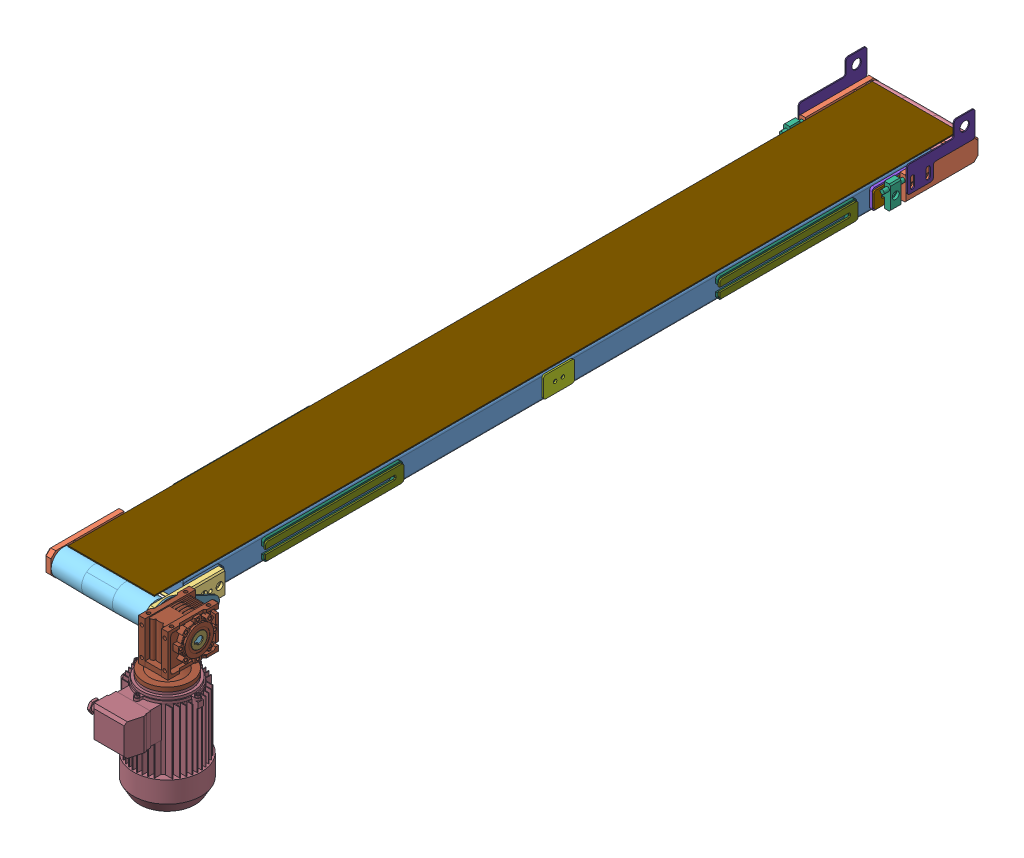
SolidWorks assembly 14k040 convoyeur inox 1518.SLDASM, configuration Défaut (file format 10000). Lengths in mm.
Overall size (315.5 318 1712.65).
39 component instances, 18 part files, 65 mates.
Components (placement in the parent):
- 14k277 bati inox conv 700-1: 14k277 bati inox conv 700.SLDPRT [Défaut<Brut d'usinage>] at (-62.6526 12.5437 350) size (165 45 1435)
- 14K268V6411 support rouleau2-1: 14K268V6411 support rouleau2.SLDPRT [Défaut] at (87.8474 12.5437 -1080) x (0 1 0) z (1 0 0) size (45 140 28.5)
- 14K268V6411 support rouleau2-2: 14K268V6411 support rouleau2.SLDPRT [Défaut] at (-93.1526 12.5437 -1080) x (0 -1 0) z (-1 0 0) size (45 140 28.5)
- 14K268V6411 support rouleau2-3: 14K268V6411 support rouleau2.SLDPRT [Défaut] at (-93.1526 12.0052 399.9955) x (0 1 0) z (-1 0 0) size (45 140 28.5)
- 14k275 V6413  support rouleau arbre-1: 14k275 V6413  support rouleau arbre.SLDPRT [Défaut] at (87.8474 12.0052 399.9955) x (0 -1 0) z (1 0 0) size (45 140 28.5)
- 14k269 V1413 rouleau.Stp-1: 14k269 V1413 rouleau.Stp.SLDPRT [Défaut] at (-91.1526 12.4763 -1111.0098) x (0 -0.225951 -0.974139) z (0 -0.974139 0.225951) size (50 199 50)
- 14k276 V1563 rouleau arbre long-1: 14k276 V1563 rouleau arbre long.SLDPRT [Défaut] at (89.8474 12.371 431.4073) x (0 0.521759 0.853093) z (0 -0.853093 0.521759) size (50.22 309.04 50.51)
- 14K268 V6445 bloqueur bande-3: 14K268 V6445 bloqueur bande.SLDPRT [Défaut] at (87.8474 12.5437 -865) x (0 -1 0) z (1 0 0) size (45 40 15)
- 14K268 V6445 bloqueur bande-4: 14K268 V6445 bloqueur bande.SLDPRT [Défaut] at (-93.1526 12.5437 -1080) x (0 -1 0) z (-1 0 0) size (45 40 15)
- 14k401-1: 14k401.SLDPRT [Défaut] at (-88.1526 -6.9563 -314.5) x (0 0 -1) z (1 0 0) size (60 40 3)
- 14k401-2: 14k401.SLDPRT [Défaut] at (82.8474 -6.9563 -374.5) x (0 0 1) z (-1 0 0) size (60 40 3)
- 14k402 rainure-1: 14k402 rainure.SLDASM [Défaut] at (-85.1526 -6.9563 -1062.5) x (0 0 1) z (-1 0 0) size (120 38 8)
  - 14k402 piece rainure 1-1: 14k402 piece rainure 1.SLDPRT [Défaut] at origin size (120 38 5)
  - 14k402 piece rainure 2-1: 14k402 piece rainure 2.SLDPRT [Défaut] at (0 3 5) size (120 32 3)
- 14k402 rainure-2: 14k402 rainure.SLDASM [Défaut] at (79.8474 31.0437 -1062.5) x (0 0 1) z (1 0 0) size (120 38 8)
  - 14k402 piece rainure 1-1: 14k402 piece rainure 1.SLDPRT [Défaut] at origin size (120 38 5)
  - 14k402 piece rainure 2-1: 14k402 piece rainure 2.SLDPRT [Défaut] at (0 3 5) size (120 32 3)
- 14K403 piece fixation ep9-1: 14K403 piece fixation ep9.SLDPRT [Défaut] at (-85.1526 -6.9563 302.5) x (0 0 1) z (-1 0 0) size (70 38 8)
- 14K403 piece fixation ep9-2: 14K403 piece fixation ep9.SLDPRT [Défaut] at (79.8474 -6.9563 372.5) x (0 0 -1) z (1 0 0) size (70 38 8)
- CHM30-20-63C4-1: CHM30-20-63C4.SLDASM [Défaut] at (138.8474 12.0405 431.641) x (0 -1 0) z (-1 0 0) size (287 180 130)
  - HI_hpc_CHM30-20-63C4_1-1: HI_hpc_CHM30-20-63C4_1.sldprt [Défaut] x (0 0 -1) z (1 0 0) size (90 115 95)
  - HI_hpc_CHM30-MOT_3-1: HI_hpc_CHM30-MOT_3.sldprt [Défaut] at origin size (30 30 63)
  - HI_hpc_CHM30-20-63C4_2-1: HI_hpc_CHM30-20-63C4_2.sldprt [Défaut] at (52.5 30 0) size (194.5 175 130)
- HPC_-_CHM30-BR-1: HPC_-_CHM30-BR.SLDPRT [Défaut] at (108.0974 12.0405 431.641) x (1 0 0) z (0 -0.986223 0.165424) size (14 138 76)
- 14L402 Rainure 250mm-3: 14L402 Rainure 250mm.SLDASM [Défaut] at (-88.1526 114.338 -807.3486) x (0 0 -1) z (-1 0 0) size (265 38 8)
  - 14L402 piece rainure 1-1: 14L402 piece rainure 1.SLDPRT [Défaut] at (-159.8486 83.2943 -3) size (265 38 5)
  - 14L402 piece rainure 2-1: 14L402 piece rainure 2.SLDPRT [Défaut] at (-159.8486 86.2943 2) size (265 32 3)
- 14L402 Rainure 250mm-4: 14L402 Rainure 250mm.SLDASM [Défaut] at (82.8474 -90.2507 -807.3486) x (0 0 -1) z (1 0 0) size (265 38 8)
  - 14L402 piece rainure 1-1: 14L402 piece rainure 1.SLDPRT [Défaut] at (-159.8486 83.2943 -3) size (265 38 5)
  - 14L402 piece rainure 2-1: 14L402 piece rainure 2.SLDPRT [Défaut] at (-159.8486 86.2943 2) size (265 32 3)
- 14L402 Rainure 250mm-5: 14L402 Rainure 250mm.SLDASM [Défaut] at (82.8474 -90.2507 62.6514) x (0 0 -1) z (1 0 0) size (265 38 8)
  - 14L402 piece rainure 1-1: 14L402 piece rainure 1.SLDPRT [Défaut] at (-159.8486 83.2943 -3) size (265 38 5)
  - 14L402 piece rainure 2-1: 14L402 piece rainure 2.SLDPRT [Défaut] at (-159.8486 86.2943 2) size (265 32 3)
- 14L402 Rainure 250mm-6: 14L402 Rainure 250mm.SLDASM [Défaut] at (-88.1526 118.338 62.6514) x (0 0 -1) z (-1 0 0) size (265 38 8)
  - 14L402 piece rainure 1-1: 14L402 piece rainure 1.SLDPRT [Défaut] at (-159.8486 83.2943 -3) size (265 38 5)
  - 14L402 piece rainure 2-1: 14L402 piece rainure 2.SLDPRT [Défaut] at (-159.8486 86.2943 2) size (265 32 3)
- 14k205 support capteur-1: 14k205 support capteur.SLDPRT [Défaut] at (96.8474 3.0437 -992.5) x (0 0 -1) z (1 0 0) size (130 80 2)
- 14k205 support capteur-2: 14k205 support capteur.SLDPRT [Défaut] at (-110.1526 2.5437 -992.5) x (0 0 -1) z (1 0 0) size (130 80 2)
- 17Abande A1-1: 17Abande A1.SLDPRT [Défaut] at (40.995 37.0437 -994.3689) x (0 0 1) z (0 1 0) size (1540 165 2)
Mates (geometry in assembly coordinates):
- Distance1: distance = 3 mm anti-aligned: plane of 14K268V6411 support rouleau2-2 through (-103.6526 29.5921 -1127.0482) normal (1 0 0); plane of 14k269 V1413 rouleau.Stp-1 through (-100.6526 12.4763 -1111.0098) normal (-1 0 0)
- Coïncidente113: coincident: plane of 14k277 bati inox conv 700-1 through (-44.1526 35.0437 350) normal (0 1 0); line of 14K268V6411 support rouleau2-2 through (-93.1526 35.0437 -1123.5) axis (0 0 1)
- Coïncidente35: coincident aligned: plane of 14K268V6411 support rouleau2-1 through (87.3729 27.3923 -1132.5) normal (0 0 -1); plane of 14K268V6411 support rouleau2-2 through (-92.678 -2.305 -1132.5) normal (0 0 -1)
- Coïncidente38: coincident aligned: plane of 14K268V6411 support rouleau2-3 through (-92.678 26.8539 452.4955) normal (0 0 1); plane of 14k275 V6413  support rouleau arbre-1 through (87.3729 -2.8434 452.4955) normal (0 0 1)
- Coaxiale5: concentric aligned: circle of 14K268V6411 support rouleau2-2; cylinder of 14k269 V1413 rouleau.Stp-1 through (-100.6526 12.4763 -1111.0098) axis (1 0 0) radius 17.5
- Coïncidente112: coincident aligned: plane of 14K268 V6445 bloqueur bande-3 through (92.5974 35.0437 -972.5) normal (0 1 0); plane of 14K268V6411 support rouleau2-1 through (97.822 35.0437 -1130.0435) normal (0 1 0)
- Coïncidente48: coincident anti-aligned: plane of 14K268V6411 support rouleau2-1 through (100.5967 37.2914 -992.5) normal (0 0 1); plane of 14K268 V6445 bloqueur bande-3 through (93.8474 25.0437 -992.5) normal (0 0 -1)
- Coïncidente114: coincident aligned: plane of 14k277 bati inox conv 700-1 through (38.8474 35.0437 -1040) normal (0 1 0); plane of 14K268V6411 support rouleau2-1 through (97.822 35.0437 -1130.0435) normal (0 1 0)
- Coïncidente51: coincident anti-aligned: plane of 14K268V6411 support rouleau2-2 through (-105.9018 -12.2041 -992.5) normal (0 0 1); plane of 14K268 V6445 bloqueur bande-4 through (-99.1526 25.0437 -992.5) normal (0 0 -1)
- Coïncidente52: coincident aligned: plane of 14K268 V6445 bloqueur bande-4 through (-97.9026 35.0437 -972.5) normal (0 1 0); plane of 14K268V6411 support rouleau2-2 through (-92.678 35.0437 -1130.0435) normal (0 1 0)
- Coïncidente53: coincident anti-aligned: plane of 14k277 bati inox conv 700-1 through (-85.1526 -5.9563 350) normal (-1 0 0); plane of 14k401-1 through (-85.1526 33.0437 -314.5) normal (1 0 0)
- Distance27: distance = 2 mm aligned: plane of 14k277 bati inox conv 700-1 through (-44.1526 35.0437 350) normal (0 1 0); plane of 14k401-1 through (-85.1526 33.0437 -314.5) normal (0 1 0)
- Coïncidente57: coincident anti-aligned: plane of 14k277 bati inox conv 700-1 through (79.8474 -5.9563 -1040) normal (1 0 0); plane of 14k401-2 through (79.8474 33.0437 -374.5) normal (-1 0 0)
- Distance26: distance = 2 mm aligned: plane of 14k401-2 through (79.8474 33.0437 -374.5) normal (0 1 0); line of 14k277 bati inox conv 700-1 through (75.8474 35.0437 -1058.5) axis (0 0 1)
- Coïncidente61: coincident aligned: plane of 14k401-1 through (-85.1526 -6.9563 -314.5) normal (0 0 1); plane of 14k401-2 through (79.8474 -6.9563 -314.5) normal (0 0 1)
- Coïncidente82: coincident anti-aligned: plane of 14k277 bati inox conv 700-1 through (79.8474 -5.9563 -1040) normal (1 0 0); plane of 14k402 rainure-2/14k402 piece rainure 1-1 through (79.8474 -6.9563 -1062.5) normal (-1 0 0)
- Distance20: distance = 4 mm aligned: plane of 14k277 bati inox conv 700-1 through (38.8474 35.0437 -1040) normal (0 1 0); plane of 14k402 rainure-2/14k402 piece rainure 1-1 through (84.8474 31.0437 -1062.5) normal (0 1 0)
- Coïncidente85: coincident anti-aligned: plane of 14k277 bati inox conv 700-1 through (-85.1526 -5.9563 350) normal (-1 0 0); plane of 14k402 rainure-1/14k402 piece rainure 1-1 through (-85.1526 31.0437 -1062.5) normal (1 0 0)
- Distance19: distance = 4 mm aligned: plane of 14k277 bati inox conv 700-1 through (-44.1526 35.0437 350) normal (0 1 0); plane of 14k402 rainure-1/14k402 piece rainure 1-1 through (-90.1526 31.0437 -1062.5) normal (0 1 0)
- Coïncidente87: coincident aligned: plane of 14k402 rainure-1/14k402 piece rainure 1-1 through (-90.1526 -6.9563 -942.5) normal (0 0 1); plane of 14k402 rainure-2/14k402 piece rainure 1-1 through (84.8474 31.0437 -942.5) normal (0 0 1)
- Coïncidente88: coincident anti-aligned: plane of 14K268V6411 support rouleau2-1 through (87.8474 -12.2041 -1139.493) normal (-1 0 0); plane of 14k402 rainure-2/14k402 piece rainure 2-1 through (87.8474 -3.9563 -1062.5) normal (1 0 0)
- Coïncidente89: coincident anti-aligned: plane of 14K268 V6445 bloqueur bande-3 through (87.8474 23.7937 -972.5) normal (-1 0 0); plane of 14k402 rainure-2/14k402 piece rainure 2-1 through (87.8474 -3.9563 -1062.5) normal (1 0 0)
- Coïncidente90: coincident anti-aligned: plane of 14K268V6411 support rouleau2-2 through (-93.1526 37.2914 -1139.493) normal (1 0 0); plane of 14k402 rainure-1/14k402 piece rainure 2-1 through (-93.1526 28.0437 -1062.5) normal (-1 0 0)
- Coïncidente91: coincident anti-aligned: plane of 14K268 V6445 bloqueur bande-4 through (-93.1526 23.7937 -972.5) normal (1 0 0); plane of 14k402 rainure-1/14k402 piece rainure 2-1 through (-93.1526 28.0437 -1062.5) normal (-1 0 0)
- Distance9: distance = 100 mm anti-aligned: plane of 14K268 V6445 bloqueur bande-4 through (-97.6526 12.5437 -962.5) normal (0 0 1); line of 14k277 bati inox conv 700-1 through (-85.1526 31.0437 -1062.5) axis (1 0 0)
- Distance10: distance = 120 mm anti-aligned: plane of 14k277 bati inox conv 700-1 through (-62.6526 -5.9563 -1062.5) normal (0 0 -1); plane of 14k402 rainure-1/14k402 piece rainure 1-1 through (-90.1526 -6.9563 -942.5) normal (0 0 1)
- Coïncidente94: coincident anti-aligned: plane of 14k277 bati inox conv 700-1 through (-85.1526 -5.9563 350) normal (-1 0 0); plane of 14K403 piece fixation ep9-1 through (-85.1526 31.0437 302.5) normal (1 0 0)
- Distance17: distance = 4 mm aligned: plane of 14k277 bati inox conv 700-1 through (-44.1526 35.0437 350) normal (0 1 0); plane of 14K403 piece fixation ep9-1 through (-93.1526 31.0437 302.5) normal (0 1 0)
- Coïncidente96: coincident anti-aligned: plane of 14k277 bati inox conv 700-1 through (79.8474 -5.9563 -1040) normal (1 0 0); plane of 14K403 piece fixation ep9-2 through (79.8474 31.0437 372.5) normal (-1 0 0)
- Distance18: distance = 4 mm aligned: plane of 14k277 bati inox conv 700-1 through (38.8474 35.0437 -1040) normal (0 1 0); plane of 14K403 piece fixation ep9-2 through (87.8474 31.0437 372.5) normal (0 1 0)
- Coïncidente98: coincident aligned: plane of 14K403 piece fixation ep9-1 through (-93.1526 -6.9563 372.5) normal (0 0 1); plane of 14K403 piece fixation ep9-2 through (87.8474 -6.9563 372.5) normal (0 0 1)
- Coïncidente99: coincident aligned: plane of 14k277 bati inox conv 700-1 through (57.3474 -5.9563 372.5) normal (0 0 1); plane of 14K403 piece fixation ep9-1 through (-93.1526 -6.9563 372.5) normal (0 0 1)
- Coaxiale18: concentric aligned: circle of 14k275 V6413  support rouleau arbre-1; circle of 14K403 piece fixation ep9-2
- Coïncidente105: coincident anti-aligned: plane of 14k275 V6413  support rouleau arbre-1 through (87.8474 36.753 459.4885) normal (-1 0 0); plane of 14K403 piece fixation ep9-2 through (87.8474 31.0437 372.5) normal (1 0 0)
- Coïncidente108: coincident aligned: plane of 14K268V6411 support rouleau2-3 through (-103.1271 34.5052 450.039) normal (0 1 0); plane of 14k275 V6413  support rouleau arbre-1 through (87.3729 34.5052 450.039) normal (0 1 0)
- Coïncidente109: coincident anti-aligned: plane of 14K268V6411 support rouleau2-3 through (-93.1526 -12.7425 459.4885) normal (1 0 0); plane of 14K403 piece fixation ep9-1 through (-93.1526 31.0437 302.5) normal (-1 0 0)
- Parallèle2: parallel aligned: plane of 14k275 V6413  support rouleau arbre-1 through (87.3729 -2.8434 452.4955) normal (0 0 1); plane of 14K403 piece fixation ep9-2 through (87.8474 -6.9563 372.5) normal (0 0 1)
- Distance16: distance = 8 mm aligned: plane of 14k401-1 through (-85.1526 -6.9563 -314.5) normal (0 0 1); plane of 14k277 bati inox conv 700-1 through (57.3474 -5.9563 -322.5) normal (0 0 1)
- Coaxiale23: concentric anti-aligned: circle of 14K268V6411 support rouleau2-3; circle of 14k276 V1563 rouleau arbre long-1
- Distance21: distance = 3 mm anti-aligned: plane of 14k276 V1563 rouleau arbre long-1 through (-100.6526 5.9937 457.8706) normal (-1 0 0); plane of 14K268V6411 support rouleau2-3 through (-103.6526 -5.0432 447.0437) normal (1 0 0)
- Coaxiale24: concentric anti-aligned: circle of 14k276 V1563 rouleau arbre long-1; cylinder of CHM30-20-63C4-1/HI_hpc_CHM30-MOT_3-1 through (107.3474 12.0405 431.641) axis (-1 0 0) radius 7
- Parallèle3: parallel aligned: plane of 14k275 V6413  support rouleau arbre-1 through (87.3729 34.5052 450.039) normal (0 1 0); plane of CHM30-20-63C4-1/HI_hpc_CHM30-20-63C4_1-1 through (138.8474 52.0405 431.641) normal (0 1 0)
- Distance22: distance = 10 mm anti-aligned: plane of CHM30-20-63C4-1/HI_hpc_CHM30-20-63C4_1-1 through (109.8474 12.0405 459.141) normal (-1 0 0); plane of 14k275 V6413  support rouleau arbre-1 through (99.8474 -9.9928 456.8637) normal (1 0 0)
- Coaxiale25: concentric anti-aligned: circle of 14k276 V1563 rouleau arbre long-1; cylinder of HPC_-_CHM30-BR-1 through (109.8474 12.0405 431.641) axis (-1 0 0) radius 27.5
- Coïncidente116: coincident anti-aligned: plane of CHM30-20-63C4-1/HI_hpc_CHM30-20-63C4_1-1 through (109.8474 12.0405 459.141) normal (-1 0 0); plane of HPC_-_CHM30-BR-1 through (109.8474 -42.5651 338.5634) normal (1 0 0)
- Coïncidente123: coincident anti-aligned: plane of 14k277 bati inox conv 700-1 through (79.8474 -5.9563 -1040) normal (1 0 0); plane of 14L402 Rainure 250mm-4/14L402 piece rainure 1-1 through (79.8474 31.0437 -647.5) normal (-1 0 0)
- Coïncidente125: coincident anti-aligned: plane of 14L402 Rainure 250mm-3/14L402 piece rainure 1-1 through (-85.1526 -6.9563 -647.5) normal (1 0 0); plane of 14k277 bati inox conv 700-1 through (-85.1526 -5.9563 350) normal (-1 0 0)
- Coïncidente126: coincident aligned: plane of 14L402 Rainure 250mm-3/14L402 piece rainure 1-1 through (-90.1526 31.0437 -912.5) normal (0 0 -1); plane of 14L402 Rainure 250mm-4/14L402 piece rainure 1-1 through (84.8474 -6.9563 -912.5) normal (0 0 -1)
- Coïncidente127: coincident aligned: plane of 14L402 Rainure 250mm-3/14L402 piece rainure 1-1 through (-90.1526 31.0437 -647.5) normal (0 1 0); plane of 14L402 Rainure 250mm-4/14L402 piece rainure 1-1 through (84.8474 31.0437 -647.5) normal (0 1 0)
- Distance24: distance = 150 mm aligned: plane of 14L402 Rainure 250mm-4/14L402 piece rainure 1-1 through (84.8474 -6.9563 -912.5) normal (0 0 -1); plane of 14k277 bati inox conv 700-1 through (-62.6526 -5.9563 -1062.5) normal (0 0 -1)
- Coïncidente128: coincident anti-aligned: plane of 14k277 bati inox conv 700-1 through (79.8474 -5.9563 -1040) normal (1 0 0); plane of 14L402 Rainure 250mm-5/14L402 piece rainure 1-1 through (79.8474 31.0437 222.5) normal (-1 0 0)
- Coïncidente129: coincident aligned: plane of 14L402 Rainure 250mm-4/14L402 piece rainure 1-1 through (84.8474 31.0437 -647.5) normal (0 1 0); plane of 14L402 Rainure 250mm-5/14L402 piece rainure 1-1 through (84.8474 31.0437 222.5) normal (0 1 0)
- Coïncidente130: coincident anti-aligned: plane of 14L402 Rainure 250mm-6/14L402 piece rainure 1-1 through (-85.1526 -2.9563 222.5) normal (1 0 0); plane of 14k277 bati inox conv 700-1 through (-85.1526 -5.9563 350) normal (-1 0 0)
- Coïncidente131: coincident aligned: plane of 14L402 Rainure 250mm-6/14L402 piece rainure 1-1 through (-90.1526 35.0437 222.5) normal (0 1 0); plane of 14k277 bati inox conv 700-1 through (-44.1526 35.0437 350) normal (0 1 0)
- Coïncidente132: coincident aligned: plane of 14L402 Rainure 250mm-5/14L402 piece rainure 1-1 through (84.8474 -6.9563 222.5) normal (0 0 1); plane of 14L402 Rainure 250mm-6/14L402 piece rainure 1-1 through (-90.1526 35.0437 222.5) normal (0 0 1)
- Distance25: distance = 150 mm aligned: plane of 14L402 Rainure 250mm-5/14L402 piece rainure 1-1 through (84.8474 -6.9563 222.5) normal (0 0 1); plane of 14k277 bati inox conv 700-1 through (57.3474 -5.9563 372.5) normal (0 0 1)
- Coïncidente133: coincident: plane of 14K268V6411 support rouleau2-1 through (99.8474 34.5417 -1136.8681) normal (1 0 0); plane of 14k205 support capteur-1 through (99.8474 3.0437 -992.5) normal (-1 0 0)
- Distance28: distance = 13 mm: plane of 14k205 support capteur-1 through (101.8474 3.0437 -1042.5) normal (0 -1 0); plane of 14K268V6411 support rouleau2-1 through (87.3729 -9.9563 -1130.0435) normal (0 -1 0)
- Coïncidente136: coincident aligned: plane of 14K268V6411 support rouleau2-1 through (100.5967 37.2914 -992.5) normal (0 0 1); plane of 14k205 support capteur-1 through (101.8474 3.0437 -992.5) normal (0 0 1)
- Coïncidente137: coincident: plane of 14K268V6411 support rouleau2-2 through (-105.1526 -9.4543 -1136.8681) normal (-1 0 0); plane of 14k205 support capteur-2 through (-105.1526 2.5437 -992.5) normal (1 0 0)
- Distance29: distance = 12.5 mm: plane of 14k205 support capteur-2 through (-105.1526 2.5437 -1042.5) normal (0 -1 0); plane of 14K268V6411 support rouleau2-2 through (-103.1271 -9.9563 -1130.0435) normal (0 -1 0)
- Coïncidente139: coincident aligned: plane of 14K268V6411 support rouleau2-2 through (-105.9018 -12.2041 -992.5) normal (0 0 1); plane of 14k205 support capteur-2 through (-105.1526 2.5437 -992.5) normal (0 0 1)
- Distance30: distance = 2 mm anti-aligned: plane of 17Abande A1-1 through (40.995 37.0437 -994.3689) normal (0 -1 0); plane of 14k277 bati inox conv 700-1 through (38.8474 35.0437 -1040) normal (0 1 0)
- Coïncidente143: coincident: plane of 14k277 bati inox conv 700-1 through (79.8474 -5.9563 -1040) normal (1 0 0); line of 17Abande A1-1 through (79.8474 39.0437 427.5) axis (0 0 -1)
- Distance32: distance = 50 mm: line of 17Abande A1-1 through (79.8474 39.0437 -1112.5) axis (-1 0 0); plane of 14k277 bati inox conv 700-1 through (-62.6526 -5.9563 -1062.5) normal (0 0 -1)
